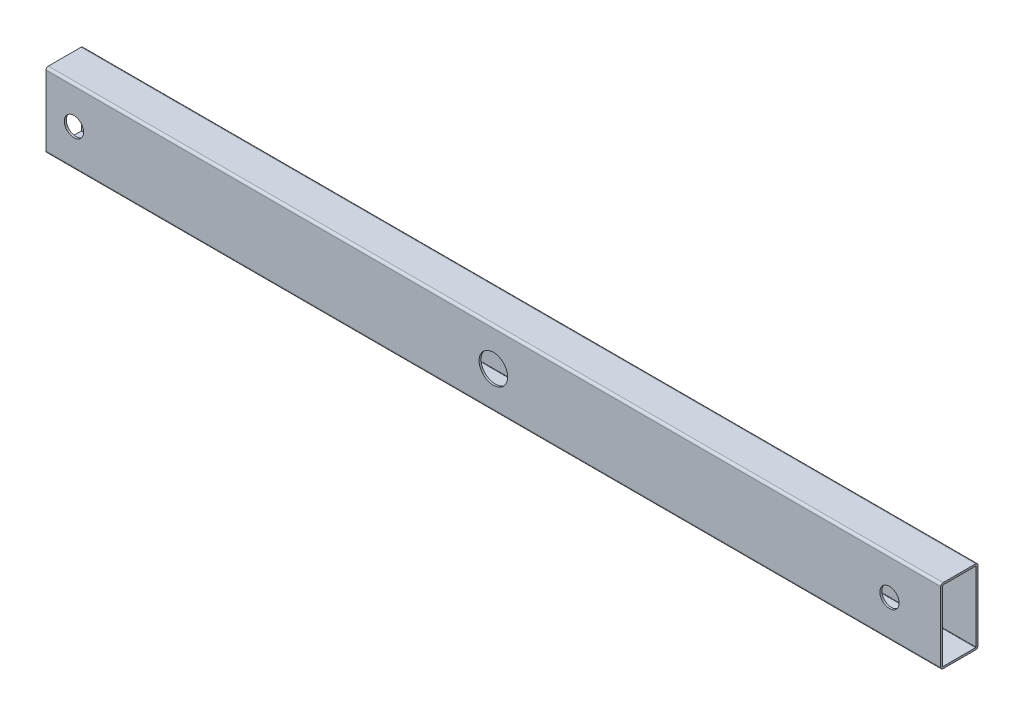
ISO-10303-21;
HEADER;
FILE_DESCRIPTION(('STEP AP214'),'2;1');
FILE_NAME('part.step','',(''),(''),'','','');
FILE_SCHEMA(('AUTOMOTIVE_DESIGN { 1 0 10303 214 1 1 1 1 }'));
ENDSEC;
DATA;
#1=APPLICATION_CONTEXT('core data for automotive mechanical design processes');
#2=APPLICATION_PROTOCOL_DEFINITION('international standard','automotive_design',2000,#1);
#3=PRODUCT_CONTEXT('',#1,'mechanical');
#4=PRODUCT('Part','Part','',(#3));
#5=PRODUCT_RELATED_PRODUCT_CATEGORY('part','',(#4));
#6=PRODUCT_DEFINITION_FORMATION('','',#4);
#7=PRODUCT_DEFINITION_CONTEXT('part definition',#1,'design');
#8=PRODUCT_DEFINITION('design','',#6,#7);
#9=PRODUCT_DEFINITION_SHAPE('','',#8);
#10=(LENGTH_UNIT() NAMED_UNIT(*) SI_UNIT(.MILLI.,.METRE.));
#11=(NAMED_UNIT(*) PLANE_ANGLE_UNIT() SI_UNIT($,.RADIAN.));
#12=(NAMED_UNIT(*) SI_UNIT($,.STERADIAN.) SOLID_ANGLE_UNIT());
#13=UNCERTAINTY_MEASURE_WITH_UNIT(LENGTH_MEASURE(1.E-05),#10,'distance_accuracy_value','');
#14=(GEOMETRIC_REPRESENTATION_CONTEXT(3) GLOBAL_UNCERTAINTY_ASSIGNED_CONTEXT((#13)) GLOBAL_UNIT_ASSIGNED_CONTEXT((#10,
#11,#12)) REPRESENTATION_CONTEXT('',''));
#15=CARTESIAN_POINT('',(0.,0.,0.));
#16=DIRECTION('',(0.,0.,1.));
#17=DIRECTION('',(1.,0.,0.));
#18=AXIS2_PLACEMENT_3D('',#15,#16,#17);
#19=CARTESIAN_POINT('',(609.6,3.65674086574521,-16.8519621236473));
#20=DIRECTION('',(-1.,0.,0.));
#21=DIRECTION('',(0.,0.,1.));
#22=AXIS2_PLACEMENT_3D('',#19,#20,#21);
#23=PLANE('',#22);
#24=CARTESIAN_POINT('',(609.6,3.65674086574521,-16.8519621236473));
#25=DIRECTION('',(1.,0.,0.));
#26=DIRECTION('',(0.,0.,1.));
#27=AXIS2_PLACEMENT_3D('',#24,#25,#26);
#28=CIRCLE('',#27,1.5875);
#29=CARTESIAN_POINT('',(609.6,3.6567408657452,-18.4394621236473));
#30=VERTEX_POINT('',#29);
#31=CARTESIAN_POINT('',(609.6,5.24424086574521,-16.8519621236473));
#32=VERTEX_POINT('',#31);
#33=EDGE_CURVE('E215',#30,#32,#28,.T.);
#34=ORIENTED_EDGE('',*,*,#33,.T.);
#35=DIRECTION('',(0.,0.,1.));
#36=VECTOR('',#35,1.);
#37=CARTESIAN_POINT('',(609.6,5.24424086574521,5.37303787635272));
#38=LINE('',#37,#36);
#39=CARTESIAN_POINT('',(609.6,5.24424086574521,5.37303787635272));
#40=VERTEX_POINT('',#39);
#41=EDGE_CURVE('E218',#32,#40,#38,.T.);
#42=ORIENTED_EDGE('',*,*,#41,.T.);
#43=CARTESIAN_POINT('',(609.6,3.65674086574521,5.37303787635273));
#44=DIRECTION('',(1.,0.,0.));
#45=DIRECTION('',(0.,0.,1.));
#46=AXIS2_PLACEMENT_3D('',#43,#44,#45);
#47=CIRCLE('',#46,1.5875);
#48=CARTESIAN_POINT('',(609.6,3.6567408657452,6.96053787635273));
#49=VERTEX_POINT('',#48);
#50=EDGE_CURVE('E221',#40,#49,#47,.T.);
#51=ORIENTED_EDGE('',*,*,#50,.T.);
#52=DIRECTION('',(0.,-1.,0.));
#53=VECTOR('',#52,1.);
#54=CARTESIAN_POINT('',(609.6,3.6567408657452,6.96053787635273));
#55=LINE('',#54,#53);
#56=CARTESIAN_POINT('',(609.6,-43.9682591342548,6.96053787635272));
#57=VERTEX_POINT('',#56);
#58=EDGE_CURVE('E223',#49,#57,#55,.T.);
#59=ORIENTED_EDGE('',*,*,#58,.T.);
#60=CARTESIAN_POINT('',(609.6,-43.9682591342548,5.37303787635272));
#61=DIRECTION('',(1.,0.,0.));
#62=DIRECTION('',(0.,0.,1.));
#63=AXIS2_PLACEMENT_3D('',#60,#61,#62);
#64=CIRCLE('',#63,1.5875);
#65=CARTESIAN_POINT('',(609.6,-45.5557591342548,5.37303787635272));
#66=VERTEX_POINT('',#65);
#67=EDGE_CURVE('E225',#57,#66,#64,.T.);
#68=ORIENTED_EDGE('',*,*,#67,.T.);
#69=DIRECTION('',(0.,0.,-1.));
#70=VECTOR('',#69,1.);
#71=CARTESIAN_POINT('',(609.6,-45.5557591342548,5.37303787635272));
#72=LINE('',#71,#70);
#73=CARTESIAN_POINT('',(609.6,-45.5557591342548,-16.8519621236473));
#74=VERTEX_POINT('',#73);
#75=EDGE_CURVE('E227',#66,#74,#72,.T.);
#76=ORIENTED_EDGE('',*,*,#75,.T.);
#77=CARTESIAN_POINT('',(609.6,-43.9682591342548,-16.8519621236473));
#78=DIRECTION('',(1.,0.,0.));
#79=DIRECTION('',(0.,0.,1.));
#80=AXIS2_PLACEMENT_3D('',#77,#78,#79);
#81=CIRCLE('',#80,1.5875);
#82=CARTESIAN_POINT('',(609.6,-43.9682591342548,-18.4394621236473));
#83=VERTEX_POINT('',#82);
#84=EDGE_CURVE('E229',#74,#83,#81,.T.);
#85=ORIENTED_EDGE('',*,*,#84,.T.);
#86=DIRECTION('',(0.,1.,0.));
#87=VECTOR('',#86,1.);
#88=CARTESIAN_POINT('',(609.6,3.6567408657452,-18.4394621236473));
#89=LINE('',#88,#87);
#90=EDGE_CURVE('E231',#83,#30,#89,.T.);
#91=ORIENTED_EDGE('',*,*,#90,.T.);
#92=EDGE_LOOP('',(#34,#42,#51,#59,#68,#76,#85,#91));
#93=FACE_BOUND('',#92,.T.);
#94=CARTESIAN_POINT('',(609.6,3.65674086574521,5.37303787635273));
#95=DIRECTION('',(1.,0.,0.));
#96=DIRECTION('',(0.,0.,1.));
#97=AXIS2_PLACEMENT_3D('',#94,#95,#96);
#98=CIRCLE('',#97,0.2413);
#99=CARTESIAN_POINT('',(609.6,3.89804086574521,5.37303787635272));
#100=VERTEX_POINT('',#99);
#101=CARTESIAN_POINT('',(609.6,3.6567408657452,5.61433787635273));
#102=VERTEX_POINT('',#101);
#103=EDGE_CURVE('E148',#100,#102,#98,.T.);
#104=ORIENTED_EDGE('',*,*,#103,.F.);
#105=DIRECTION('',(0.,0.,1.));
#106=VECTOR('',#105,1.);
#107=CARTESIAN_POINT('',(609.6,3.89804086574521,5.37303787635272));
#108=LINE('',#107,#106);
#109=CARTESIAN_POINT('',(609.6,3.89804086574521,-16.8519621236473));
#110=VERTEX_POINT('',#109);
#111=EDGE_CURVE('E182',#110,#100,#108,.T.);
#112=ORIENTED_EDGE('',*,*,#111,.F.);
#113=CARTESIAN_POINT('',(609.6,3.65674086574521,-16.8519621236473));
#114=DIRECTION('',(1.,0.,0.));
#115=DIRECTION('',(0.,0.,1.));
#116=AXIS2_PLACEMENT_3D('',#113,#114,#115);
#117=CIRCLE('',#116,0.2413);
#118=CARTESIAN_POINT('',(609.6,3.65674086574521,-17.0932621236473));
#119=VERTEX_POINT('',#118);
#120=EDGE_CURVE('E180',#119,#110,#117,.T.);
#121=ORIENTED_EDGE('',*,*,#120,.F.);
#122=DIRECTION('',(0.,1.,0.));
#123=VECTOR('',#122,1.);
#124=CARTESIAN_POINT('',(609.6,3.65674086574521,-17.0932621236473));
#125=LINE('',#124,#123);
#126=CARTESIAN_POINT('',(609.6,-43.9682591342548,-17.0932621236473));
#127=VERTEX_POINT('',#126);
#128=EDGE_CURVE('E178',#127,#119,#125,.T.);
#129=ORIENTED_EDGE('',*,*,#128,.F.);
#130=CARTESIAN_POINT('',(609.6,-43.9682591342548,-16.8519621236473));
#131=DIRECTION('',(1.,0.,0.));
#132=DIRECTION('',(0.,0.,1.));
#133=AXIS2_PLACEMENT_3D('',#130,#131,#132);
#134=CIRCLE('',#133,0.2413);
#135=CARTESIAN_POINT('',(609.6,-44.2095591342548,-16.8519621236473));
#136=VERTEX_POINT('',#135);
#137=EDGE_CURVE('E176',#136,#127,#134,.T.);
#138=ORIENTED_EDGE('',*,*,#137,.F.);
#139=DIRECTION('',(0.,0.,-1.));
#140=VECTOR('',#139,1.);
#141=CARTESIAN_POINT('',(609.6,-44.2095591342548,5.37303787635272));
#142=LINE('',#141,#140);
#143=CARTESIAN_POINT('',(609.6,-44.2095591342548,5.37303787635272));
#144=VERTEX_POINT('',#143);
#145=EDGE_CURVE('E171',#144,#136,#142,.T.);
#146=ORIENTED_EDGE('',*,*,#145,.F.);
#147=CARTESIAN_POINT('',(609.6,-43.9682591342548,5.37303787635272));
#148=DIRECTION('',(1.,0.,0.));
#149=DIRECTION('',(0.,0.,1.));
#150=AXIS2_PLACEMENT_3D('',#147,#148,#149);
#151=CIRCLE('',#150,0.2413);
#152=CARTESIAN_POINT('',(609.6,-43.9682591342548,5.61433787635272));
#153=VERTEX_POINT('',#152);
#154=EDGE_CURVE('E169',#153,#144,#151,.T.);
#155=ORIENTED_EDGE('',*,*,#154,.F.);
#156=DIRECTION('',(0.,-1.,0.));
#157=VECTOR('',#156,1.);
#158=CARTESIAN_POINT('',(609.6,3.6567408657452,5.61433787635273));
#159=LINE('',#158,#157);
#160=EDGE_CURVE('E156',#102,#153,#159,.T.);
#161=ORIENTED_EDGE('',*,*,#160,.F.);
#162=EDGE_LOOP('',(#104,#112,#121,#129,#138,#146,#155,#161));
#163=FACE_BOUND('',#162,.T.);
#164=ADVANCED_FACE('F33',(#93,#163),#23,.F.);
#165=CARTESIAN_POINT('',(0.,3.65674086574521,-16.8519621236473));
#166=DIRECTION('',(-1.,0.,0.));
#167=DIRECTION('',(0.,0.,1.));
#168=AXIS2_PLACEMENT_3D('',#165,#166,#167);
#169=PLANE('',#168);
#170=CARTESIAN_POINT('',(0.,3.65674086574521,-16.8519621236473));
#171=DIRECTION('',(1.,0.,0.));
#172=DIRECTION('',(0.,0.,1.));
#173=AXIS2_PLACEMENT_3D('',#170,#171,#172);
#174=CIRCLE('',#173,1.5875);
#175=CARTESIAN_POINT('',(0.,3.6567408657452,-18.4394621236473));
#176=VERTEX_POINT('',#175);
#177=CARTESIAN_POINT('',(0.,5.24424086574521,-16.8519621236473));
#178=VERTEX_POINT('',#177);
#179=EDGE_CURVE('E164',#176,#178,#174,.T.);
#180=ORIENTED_EDGE('',*,*,#179,.F.);
#181=DIRECTION('',(0.,1.,0.));
#182=VECTOR('',#181,1.);
#183=CARTESIAN_POINT('',(0.,3.6567408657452,-18.4394621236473));
#184=LINE('',#183,#182);
#185=CARTESIAN_POINT('',(0.,-43.9682591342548,-18.4394621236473));
#186=VERTEX_POINT('',#185);
#187=EDGE_CURVE('E219',#186,#176,#184,.T.);
#188=ORIENTED_EDGE('',*,*,#187,.F.);
#189=CARTESIAN_POINT('',(0.,-43.9682591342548,-16.8519621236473));
#190=DIRECTION('',(1.,0.,0.));
#191=DIRECTION('',(0.,0.,1.));
#192=AXIS2_PLACEMENT_3D('',#189,#190,#191);
#193=CIRCLE('',#192,1.5875);
#194=CARTESIAN_POINT('',(0.,-45.5557591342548,-16.8519621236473));
#195=VERTEX_POINT('',#194);
#196=EDGE_CURVE('E246',#195,#186,#193,.T.);
#197=ORIENTED_EDGE('',*,*,#196,.F.);
#198=DIRECTION('',(0.,0.,-1.));
#199=VECTOR('',#198,1.);
#200=CARTESIAN_POINT('',(0.,-45.5557591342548,5.37303787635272));
#201=LINE('',#200,#199);
#202=CARTESIAN_POINT('',(0.,-45.5557591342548,5.37303787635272));
#203=VERTEX_POINT('',#202);
#204=EDGE_CURVE('E244',#203,#195,#201,.T.);
#205=ORIENTED_EDGE('',*,*,#204,.F.);
#206=CARTESIAN_POINT('',(0.,-43.9682591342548,5.37303787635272));
#207=DIRECTION('',(1.,0.,0.));
#208=DIRECTION('',(0.,0.,1.));
#209=AXIS2_PLACEMENT_3D('',#206,#207,#208);
#210=CIRCLE('',#209,1.5875);
#211=CARTESIAN_POINT('',(0.,-43.9682591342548,6.96053787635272));
#212=VERTEX_POINT('',#211);
#213=EDGE_CURVE('E242',#212,#203,#210,.T.);
#214=ORIENTED_EDGE('',*,*,#213,.F.);
#215=DIRECTION('',(0.,-1.,0.));
#216=VECTOR('',#215,1.);
#217=CARTESIAN_POINT('',(0.,3.6567408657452,6.96053787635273));
#218=LINE('',#217,#216);
#219=CARTESIAN_POINT('',(0.,3.6567408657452,6.96053787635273));
#220=VERTEX_POINT('',#219);
#221=EDGE_CURVE('E240',#220,#212,#218,.T.);
#222=ORIENTED_EDGE('',*,*,#221,.F.);
#223=CARTESIAN_POINT('',(0.,3.65674086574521,5.37303787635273));
#224=DIRECTION('',(1.,0.,0.));
#225=DIRECTION('',(0.,0.,1.));
#226=AXIS2_PLACEMENT_3D('',#223,#224,#225);
#227=CIRCLE('',#226,1.5875);
#228=CARTESIAN_POINT('',(0.,5.24424086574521,5.37303787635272));
#229=VERTEX_POINT('',#228);
#230=EDGE_CURVE('E238',#229,#220,#227,.T.);
#231=ORIENTED_EDGE('',*,*,#230,.F.);
#232=DIRECTION('',(0.,0.,1.));
#233=VECTOR('',#232,1.);
#234=CARTESIAN_POINT('',(0.,5.24424086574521,5.37303787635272));
#235=LINE('',#234,#233);
#236=EDGE_CURVE('E236',#178,#229,#235,.T.);
#237=ORIENTED_EDGE('',*,*,#236,.F.);
#238=EDGE_LOOP('',(#180,#188,#197,#205,#214,#222,#231,#237));
#239=FACE_BOUND('',#238,.T.);
#240=DIRECTION('',(0.,0.,1.));
#241=VECTOR('',#240,1.);
#242=CARTESIAN_POINT('',(0.,3.89804086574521,5.37303787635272));
#243=LINE('',#242,#241);
#244=CARTESIAN_POINT('',(0.,3.89804086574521,-16.8519621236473));
#245=VERTEX_POINT('',#244);
#246=CARTESIAN_POINT('',(0.,3.89804086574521,5.37303787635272));
#247=VERTEX_POINT('',#246);
#248=EDGE_CURVE('E157',#245,#247,#243,.T.);
#249=ORIENTED_EDGE('',*,*,#248,.T.);
#250=CARTESIAN_POINT('',(0.,3.65674086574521,5.37303787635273));
#251=DIRECTION('',(1.,0.,0.));
#252=DIRECTION('',(0.,0.,1.));
#253=AXIS2_PLACEMENT_3D('',#250,#251,#252);
#254=CIRCLE('',#253,0.2413);
#255=CARTESIAN_POINT('',(0.,3.6567408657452,5.61433787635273));
#256=VERTEX_POINT('',#255);
#257=EDGE_CURVE('E58',#247,#256,#254,.T.);
#258=ORIENTED_EDGE('',*,*,#257,.T.);
#259=DIRECTION('',(0.,-1.,0.));
#260=VECTOR('',#259,1.);
#261=CARTESIAN_POINT('',(0.,3.6567408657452,5.61433787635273));
#262=LINE('',#261,#260);
#263=CARTESIAN_POINT('',(0.,-43.9682591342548,5.61433787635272));
#264=VERTEX_POINT('',#263);
#265=EDGE_CURVE('E163',#256,#264,#262,.T.);
#266=ORIENTED_EDGE('',*,*,#265,.T.);
#267=CARTESIAN_POINT('',(0.,-43.9682591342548,5.37303787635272));
#268=DIRECTION('',(1.,0.,0.));
#269=DIRECTION('',(0.,0.,1.));
#270=AXIS2_PLACEMENT_3D('',#267,#268,#269);
#271=CIRCLE('',#270,0.2413);
#272=CARTESIAN_POINT('',(0.,-44.2095591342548,5.37303787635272));
#273=VERTEX_POINT('',#272);
#274=EDGE_CURVE('E187',#264,#273,#271,.T.);
#275=ORIENTED_EDGE('',*,*,#274,.T.);
#276=DIRECTION('',(0.,0.,-1.));
#277=VECTOR('',#276,1.);
#278=CARTESIAN_POINT('',(0.,-44.2095591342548,5.37303787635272));
#279=LINE('',#278,#277);
#280=CARTESIAN_POINT('',(0.,-44.2095591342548,-16.8519621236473));
#281=VERTEX_POINT('',#280);
#282=EDGE_CURVE('E190',#273,#281,#279,.T.);
#283=ORIENTED_EDGE('',*,*,#282,.T.);
#284=CARTESIAN_POINT('',(0.,-43.9682591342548,-16.8519621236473));
#285=DIRECTION('',(1.,0.,0.));
#286=DIRECTION('',(0.,0.,1.));
#287=AXIS2_PLACEMENT_3D('',#284,#285,#286);
#288=CIRCLE('',#287,0.2413);
#289=CARTESIAN_POINT('',(0.,-43.9682591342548,-17.0932621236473));
#290=VERTEX_POINT('',#289);
#291=EDGE_CURVE('E193',#281,#290,#288,.T.);
#292=ORIENTED_EDGE('',*,*,#291,.T.);
#293=DIRECTION('',(0.,1.,0.));
#294=VECTOR('',#293,1.);
#295=CARTESIAN_POINT('',(0.,3.65674086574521,-17.0932621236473));
#296=LINE('',#295,#294);
#297=CARTESIAN_POINT('',(0.,3.65674086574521,-17.0932621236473));
#298=VERTEX_POINT('',#297);
#299=EDGE_CURVE('E196',#290,#298,#296,.T.);
#300=ORIENTED_EDGE('',*,*,#299,.T.);
#301=CARTESIAN_POINT('',(0.,3.65674086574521,-16.8519621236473));
#302=DIRECTION('',(1.,0.,0.));
#303=DIRECTION('',(0.,0.,1.));
#304=AXIS2_PLACEMENT_3D('',#301,#302,#303);
#305=CIRCLE('',#304,0.2413);
#306=EDGE_CURVE('E199',#298,#245,#305,.T.);
#307=ORIENTED_EDGE('',*,*,#306,.T.);
#308=EDGE_LOOP('',(#249,#258,#266,#275,#283,#292,#300,#307));
#309=FACE_BOUND('',#308,.T.);
#310=ADVANCED_FACE('F315',(#239,#309),#169,.T.);
#311=CARTESIAN_POINT('',(609.6,3.65674086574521,-16.8519621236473));
#312=DIRECTION('',(-1.,0.,0.));
#313=DIRECTION('',(0.,0.,1.));
#314=AXIS2_PLACEMENT_3D('',#311,#312,#313);
#315=CYLINDRICAL_SURFACE('',#314,1.5875);
#316=ORIENTED_EDGE('',*,*,#179,.T.);
#317=DIRECTION('',(-1.,0.,0.));
#318=VECTOR('',#317,1.);
#319=CARTESIAN_POINT('',(609.6,5.24424086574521,-16.8519621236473));
#320=LINE('',#319,#318);
#321=EDGE_CURVE('E11',#32,#178,#320,.T.);
#322=ORIENTED_EDGE('',*,*,#321,.F.);
#323=ORIENTED_EDGE('',*,*,#33,.F.);
#324=DIRECTION('',(-1.,0.,0.));
#325=VECTOR('',#324,1.);
#326=CARTESIAN_POINT('',(609.6,3.6567408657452,-18.4394621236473));
#327=LINE('',#326,#325);
#328=EDGE_CURVE('E233',#30,#176,#327,.T.);
#329=ORIENTED_EDGE('',*,*,#328,.T.);
#330=EDGE_LOOP('',(#316,#322,#323,#329));
#331=FACE_BOUND('',#330,.T.);
#332=ADVANCED_FACE('F35',(#331),#315,.T.);
#333=CARTESIAN_POINT('',(609.6,5.24424086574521,5.37303787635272));
#334=DIRECTION('',(0.,-1.,0.));
#335=DIRECTION('',(0.,0.,-1.));
#336=AXIS2_PLACEMENT_3D('',#333,#334,#335);
#337=PLANE('',#336);
#338=ORIENTED_EDGE('',*,*,#236,.T.);
#339=DIRECTION('',(-1.,0.,0.));
#340=VECTOR('',#339,1.);
#341=CARTESIAN_POINT('',(609.6,5.24424086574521,5.37303787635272));
#342=LINE('',#341,#340);
#343=EDGE_CURVE('E42',#40,#229,#342,.T.);
#344=ORIENTED_EDGE('',*,*,#343,.F.);
#345=ORIENTED_EDGE('',*,*,#41,.F.);
#346=ORIENTED_EDGE('',*,*,#321,.T.);
#347=EDGE_LOOP('',(#338,#344,#345,#346));
#348=FACE_BOUND('',#347,.T.);
#349=ADVANCED_FACE('F345',(#348),#337,.F.);
#350=CARTESIAN_POINT('',(609.6,3.65674086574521,5.37303787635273));
#351=DIRECTION('',(-1.,0.,0.));
#352=DIRECTION('',(0.,0.,1.));
#353=AXIS2_PLACEMENT_3D('',#350,#351,#352);
#354=CYLINDRICAL_SURFACE('',#353,1.5875);
#355=ORIENTED_EDGE('',*,*,#230,.T.);
#356=DIRECTION('',(-1.,0.,0.));
#357=VECTOR('',#356,1.);
#358=CARTESIAN_POINT('',(609.6,3.6567408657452,6.96053787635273));
#359=LINE('',#358,#357);
#360=EDGE_CURVE('E263',#49,#220,#359,.T.);
#361=ORIENTED_EDGE('',*,*,#360,.F.);
#362=ORIENTED_EDGE('',*,*,#50,.F.);
#363=ORIENTED_EDGE('',*,*,#343,.T.);
#364=EDGE_LOOP('',(#355,#361,#362,#363));
#365=FACE_BOUND('',#364,.T.);
#366=ADVANCED_FACE('F342',(#365),#354,.T.);
#367=CARTESIAN_POINT('',(609.6,3.6567408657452,6.96053787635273));
#368=DIRECTION('',(0.,0.,-1.));
#369=DIRECTION('',(0.,1.,0.));
#370=AXIS2_PLACEMENT_3D('',#367,#368,#369);
#371=PLANE('',#370);
#372=CARTESIAN_POINT('',(574.675,-20.1557591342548,6.96053787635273));
#373=DIRECTION('',(0.,0.,-1.));
#374=DIRECTION('',(0.,1.,0.));
#375=AXIS2_PLACEMENT_3D('',#372,#373,#374);
#376=CIRCLE('',#375,6.5484375);
#377=CARTESIAN_POINT('',(574.675,-13.6073216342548,6.96053787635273));
#378=VERTEX_POINT('',#377);
#379=EDGE_CURVE('E436',#378,#378,#376,.T.);
#380=ORIENTED_EDGE('',*,*,#379,.T.);
#381=EDGE_LOOP('',(#380));
#382=FACE_BOUND('',#381,.T.);
#383=CARTESIAN_POINT('',(19.05,-20.1557591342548,6.96053787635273));
#384=DIRECTION('',(0.,0.,1.));
#385=DIRECTION('',(1.,0.,0.));
#386=AXIS2_PLACEMENT_3D('',#383,#384,#385);
#387=CIRCLE('',#386,6.5484375);
#388=CARTESIAN_POINT('',(25.5984375,-20.1557591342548,6.96053787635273));
#389=VERTEX_POINT('',#388);
#390=EDGE_CURVE('E281',#389,#389,#387,.T.);
#391=ORIENTED_EDGE('',*,*,#390,.F.);
#392=EDGE_LOOP('',(#391));
#393=FACE_BOUND('',#392,.T.);
#394=CARTESIAN_POINT('',(304.8,-20.1557591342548,6.96053787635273));
#395=DIRECTION('',(0.,0.,1.));
#396=DIRECTION('',(1.,0.,0.));
#397=AXIS2_PLACEMENT_3D('',#394,#395,#396);
#398=CIRCLE('',#397,9.72343749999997);
#399=CARTESIAN_POINT('',(314.5234375,-20.1557591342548,6.96053787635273));
#400=VERTEX_POINT('',#399);
#401=EDGE_CURVE('E278',#400,#400,#398,.T.);
#402=ORIENTED_EDGE('',*,*,#401,.F.);
#403=EDGE_LOOP('',(#402));
#404=FACE_BOUND('',#403,.T.);
#405=ORIENTED_EDGE('',*,*,#221,.T.);
#406=DIRECTION('',(-1.,0.,0.));
#407=VECTOR('',#406,1.);
#408=CARTESIAN_POINT('',(609.6,-43.9682591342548,6.96053787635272));
#409=LINE('',#408,#407);
#410=EDGE_CURVE('E260',#57,#212,#409,.T.);
#411=ORIENTED_EDGE('',*,*,#410,.F.);
#412=ORIENTED_EDGE('',*,*,#58,.F.);
#413=ORIENTED_EDGE('',*,*,#360,.T.);
#414=EDGE_LOOP('',(#405,#411,#412,#413));
#415=FACE_BOUND('',#414,.T.);
#416=ADVANCED_FACE('F338',(#382,#393,#404,#415),#371,.F.);
#417=CARTESIAN_POINT('',(609.6,-43.9682591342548,5.37303787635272));
#418=DIRECTION('',(-1.,0.,0.));
#419=DIRECTION('',(0.,0.,1.));
#420=AXIS2_PLACEMENT_3D('',#417,#418,#419);
#421=CYLINDRICAL_SURFACE('',#420,1.5875);
#422=ORIENTED_EDGE('',*,*,#213,.T.);
#423=DIRECTION('',(-1.,0.,0.));
#424=VECTOR('',#423,1.);
#425=CARTESIAN_POINT('',(609.6,-45.5557591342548,5.37303787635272));
#426=LINE('',#425,#424);
#427=EDGE_CURVE('E257',#66,#203,#426,.T.);
#428=ORIENTED_EDGE('',*,*,#427,.F.);
#429=ORIENTED_EDGE('',*,*,#67,.F.);
#430=ORIENTED_EDGE('',*,*,#410,.T.);
#431=EDGE_LOOP('',(#422,#428,#429,#430));
#432=FACE_BOUND('',#431,.T.);
#433=ADVANCED_FACE('F334',(#432),#421,.T.);
#434=CARTESIAN_POINT('',(609.6,-45.5557591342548,5.37303787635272));
#435=DIRECTION('',(0.,1.,0.));
#436=DIRECTION('',(0.,0.,1.));
#437=AXIS2_PLACEMENT_3D('',#434,#435,#436);
#438=PLANE('',#437);
#439=ORIENTED_EDGE('',*,*,#204,.T.);
#440=DIRECTION('',(-1.,0.,0.));
#441=VECTOR('',#440,1.);
#442=CARTESIAN_POINT('',(609.6,-45.5557591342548,-16.8519621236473));
#443=LINE('',#442,#441);
#444=EDGE_CURVE('E254',#74,#195,#443,.T.);
#445=ORIENTED_EDGE('',*,*,#444,.F.);
#446=ORIENTED_EDGE('',*,*,#75,.F.);
#447=ORIENTED_EDGE('',*,*,#427,.T.);
#448=EDGE_LOOP('',(#439,#445,#446,#447));
#449=FACE_BOUND('',#448,.T.);
#450=ADVANCED_FACE('F330',(#449),#438,.F.);
#451=CARTESIAN_POINT('',(609.6,-43.9682591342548,-16.8519621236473));
#452=DIRECTION('',(-1.,0.,0.));
#453=DIRECTION('',(0.,0.,1.));
#454=AXIS2_PLACEMENT_3D('',#451,#452,#453);
#455=CYLINDRICAL_SURFACE('',#454,1.5875);
#456=ORIENTED_EDGE('',*,*,#196,.T.);
#457=DIRECTION('',(-1.,0.,0.));
#458=VECTOR('',#457,1.);
#459=CARTESIAN_POINT('',(609.6,-43.9682591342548,-18.4394621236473));
#460=LINE('',#459,#458);
#461=EDGE_CURVE('E251',#83,#186,#460,.T.);
#462=ORIENTED_EDGE('',*,*,#461,.F.);
#463=ORIENTED_EDGE('',*,*,#84,.F.);
#464=ORIENTED_EDGE('',*,*,#444,.T.);
#465=EDGE_LOOP('',(#456,#462,#463,#464));
#466=FACE_BOUND('',#465,.T.);
#467=ADVANCED_FACE('F326',(#466),#455,.T.);
#468=CARTESIAN_POINT('',(609.6,3.6567408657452,-18.4394621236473));
#469=DIRECTION('',(0.,0.,1.));
#470=DIRECTION('',(0.,-1.,0.));
#471=AXIS2_PLACEMENT_3D('',#468,#469,#470);
#472=PLANE('',#471);
#473=CARTESIAN_POINT('',(574.675,-20.1557591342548,-18.4394621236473));
#474=DIRECTION('',(0.,0.,-1.));
#475=DIRECTION('',(0.,1.,0.));
#476=AXIS2_PLACEMENT_3D('',#473,#474,#475);
#477=CIRCLE('',#476,6.5484375);
#478=CARTESIAN_POINT('',(574.675,-13.6073216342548,-18.4394621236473));
#479=VERTEX_POINT('',#478);
#480=EDGE_CURVE('E435',#479,#479,#477,.T.);
#481=ORIENTED_EDGE('',*,*,#480,.F.);
#482=EDGE_LOOP('',(#481));
#483=FACE_BOUND('',#482,.T.);
#484=CARTESIAN_POINT('',(19.05,-20.1557591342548,-18.4394621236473));
#485=DIRECTION('',(0.,0.,1.));
#486=DIRECTION('',(1.,0.,0.));
#487=AXIS2_PLACEMENT_3D('',#484,#485,#486);
#488=CIRCLE('',#487,6.5484375);
#489=CARTESIAN_POINT('',(25.5984375,-20.1557591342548,-18.4394621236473));
#490=VERTEX_POINT('',#489);
#491=EDGE_CURVE('E274',#490,#490,#488,.T.);
#492=ORIENTED_EDGE('',*,*,#491,.T.);
#493=EDGE_LOOP('',(#492));
#494=FACE_BOUND('',#493,.T.);
#495=CARTESIAN_POINT('',(304.8,-20.1557591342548,-18.4394621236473));
#496=DIRECTION('',(0.,0.,1.));
#497=DIRECTION('',(1.,0.,0.));
#498=AXIS2_PLACEMENT_3D('',#495,#496,#497);
#499=CIRCLE('',#498,9.72343749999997);
#500=CARTESIAN_POINT('',(314.5234375,-20.1557591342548,-18.4394621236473));
#501=VERTEX_POINT('',#500);
#502=EDGE_CURVE('E270',#501,#501,#499,.T.);
#503=ORIENTED_EDGE('',*,*,#502,.T.);
#504=EDGE_LOOP('',(#503));
#505=FACE_BOUND('',#504,.T.);
#506=ORIENTED_EDGE('',*,*,#187,.T.);
#507=ORIENTED_EDGE('',*,*,#328,.F.);
#508=ORIENTED_EDGE('',*,*,#90,.F.);
#509=ORIENTED_EDGE('',*,*,#461,.T.);
#510=EDGE_LOOP('',(#506,#507,#508,#509));
#511=FACE_BOUND('',#510,.T.);
#512=ADVANCED_FACE('F310',(#483,#494,#505,#511),#472,.F.);
#513=CARTESIAN_POINT('',(609.6,3.65674086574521,5.37303787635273));
#514=DIRECTION('',(-1.,0.,0.));
#515=DIRECTION('',(0.,0.,1.));
#516=AXIS2_PLACEMENT_3D('',#513,#514,#515);
#517=CYLINDRICAL_SURFACE('',#516,0.2413);
#518=ORIENTED_EDGE('',*,*,#257,.F.);
#519=DIRECTION('',(-1.,0.,0.));
#520=VECTOR('',#519,1.);
#521=CARTESIAN_POINT('',(609.6,3.89804086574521,5.37303787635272));
#522=LINE('',#521,#520);
#523=EDGE_CURVE('E152',#100,#247,#522,.T.);
#524=ORIENTED_EDGE('',*,*,#523,.F.);
#525=ORIENTED_EDGE('',*,*,#103,.T.);
#526=DIRECTION('',(-1.,0.,0.));
#527=VECTOR('',#526,1.);
#528=CARTESIAN_POINT('',(609.6,3.6567408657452,5.61433787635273));
#529=LINE('',#528,#527);
#530=EDGE_CURVE('E151',#102,#256,#529,.T.);
#531=ORIENTED_EDGE('',*,*,#530,.T.);
#532=EDGE_LOOP('',(#518,#524,#525,#531));
#533=FACE_BOUND('',#532,.T.);
#534=ADVANCED_FACE('F150',(#533),#517,.F.);
#535=CARTESIAN_POINT('',(609.6,3.6567408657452,5.61433787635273));
#536=DIRECTION('',(0.,0.,-1.));
#537=DIRECTION('',(0.,1.,0.));
#538=AXIS2_PLACEMENT_3D('',#535,#536,#537);
#539=PLANE('',#538);
#540=CARTESIAN_POINT('',(574.675,-20.1557591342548,5.61433787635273));
#541=DIRECTION('',(0.,0.,-1.));
#542=DIRECTION('',(0.,1.,0.));
#543=AXIS2_PLACEMENT_3D('',#540,#541,#542);
#544=CIRCLE('',#543,6.5484375);
#545=CARTESIAN_POINT('',(574.675,-13.6073216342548,5.61433787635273));
#546=VERTEX_POINT('',#545);
#547=EDGE_CURVE('E286',#546,#546,#544,.T.);
#548=ORIENTED_EDGE('',*,*,#547,.F.);
#549=EDGE_LOOP('',(#548));
#550=FACE_BOUND('',#549,.T.);
#551=CARTESIAN_POINT('',(19.05,-20.1557591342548,5.61433787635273));
#552=DIRECTION('',(0.,0.,-1.));
#553=DIRECTION('',(0.,1.,0.));
#554=AXIS2_PLACEMENT_3D('',#551,#552,#553);
#555=CIRCLE('',#554,6.5484375);
#556=CARTESIAN_POINT('',(25.5984375,-20.1557591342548,5.61433787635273));
#557=VERTEX_POINT('',#556);
#558=EDGE_CURVE('E273',#557,#557,#555,.T.);
#559=ORIENTED_EDGE('',*,*,#558,.F.);
#560=EDGE_LOOP('',(#559));
#561=FACE_BOUND('',#560,.T.);
#562=CARTESIAN_POINT('',(304.8,-20.1557591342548,5.61433787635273));
#563=DIRECTION('',(0.,0.,-1.));
#564=DIRECTION('',(0.,1.,0.));
#565=AXIS2_PLACEMENT_3D('',#562,#563,#564);
#566=CIRCLE('',#565,9.72343749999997);
#567=CARTESIAN_POINT('',(314.5234375,-20.1557591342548,5.61433787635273));
#568=VERTEX_POINT('',#567);
#569=EDGE_CURVE('E185',#568,#568,#566,.T.);
#570=ORIENTED_EDGE('',*,*,#569,.F.);
#571=EDGE_LOOP('',(#570));
#572=FACE_BOUND('',#571,.T.);
#573=ORIENTED_EDGE('',*,*,#265,.F.);
#574=ORIENTED_EDGE('',*,*,#530,.F.);
#575=ORIENTED_EDGE('',*,*,#160,.T.);
#576=DIRECTION('',(-1.,0.,0.));
#577=VECTOR('',#576,1.);
#578=CARTESIAN_POINT('',(609.6,-43.9682591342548,5.61433787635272));
#579=LINE('',#578,#577);
#580=EDGE_CURVE('E165',#153,#264,#579,.T.);
#581=ORIENTED_EDGE('',*,*,#580,.T.);
#582=EDGE_LOOP('',(#573,#574,#575,#581));
#583=FACE_BOUND('',#582,.T.);
#584=ADVANCED_FACE('F160',(#550,#561,#572,#583),#539,.T.);
#585=CARTESIAN_POINT('',(609.6,-43.9682591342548,5.37303787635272));
#586=DIRECTION('',(-1.,0.,0.));
#587=DIRECTION('',(0.,0.,1.));
#588=AXIS2_PLACEMENT_3D('',#585,#586,#587);
#589=CYLINDRICAL_SURFACE('',#588,0.2413);
#590=ORIENTED_EDGE('',*,*,#274,.F.);
#591=ORIENTED_EDGE('',*,*,#580,.F.);
#592=ORIENTED_EDGE('',*,*,#154,.T.);
#593=DIRECTION('',(-1.,0.,0.));
#594=VECTOR('',#593,1.);
#595=CARTESIAN_POINT('',(609.6,-44.2095591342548,5.37303787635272));
#596=LINE('',#595,#594);
#597=EDGE_CURVE('E212',#144,#273,#596,.T.);
#598=ORIENTED_EDGE('',*,*,#597,.T.);
#599=EDGE_LOOP('',(#590,#591,#592,#598));
#600=FACE_BOUND('',#599,.T.);
#601=ADVANCED_FACE('F300',(#600),#589,.F.);
#602=CARTESIAN_POINT('',(609.6,-44.2095591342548,5.37303787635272));
#603=DIRECTION('',(0.,1.,0.));
#604=DIRECTION('',(0.,0.,1.));
#605=AXIS2_PLACEMENT_3D('',#602,#603,#604);
#606=PLANE('',#605);
#607=ORIENTED_EDGE('',*,*,#282,.F.);
#608=ORIENTED_EDGE('',*,*,#597,.F.);
#609=ORIENTED_EDGE('',*,*,#145,.T.);
#610=DIRECTION('',(-1.,0.,0.));
#611=VECTOR('',#610,1.);
#612=CARTESIAN_POINT('',(609.6,-44.2095591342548,-16.8519621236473));
#613=LINE('',#612,#611);
#614=EDGE_CURVE('E210',#136,#281,#613,.T.);
#615=ORIENTED_EDGE('',*,*,#614,.T.);
#616=EDGE_LOOP('',(#607,#608,#609,#615));
#617=FACE_BOUND('',#616,.T.);
#618=ADVANCED_FACE('F307',(#617),#606,.T.);
#619=CARTESIAN_POINT('',(609.6,-43.9682591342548,-16.8519621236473));
#620=DIRECTION('',(-1.,0.,0.));
#621=DIRECTION('',(0.,0.,1.));
#622=AXIS2_PLACEMENT_3D('',#619,#620,#621);
#623=CYLINDRICAL_SURFACE('',#622,0.2413);
#624=ORIENTED_EDGE('',*,*,#291,.F.);
#625=ORIENTED_EDGE('',*,*,#614,.F.);
#626=ORIENTED_EDGE('',*,*,#137,.T.);
#627=DIRECTION('',(-1.,0.,0.));
#628=VECTOR('',#627,1.);
#629=CARTESIAN_POINT('',(609.6,-43.9682591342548,-17.0932621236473));
#630=LINE('',#629,#628);
#631=EDGE_CURVE('E208',#127,#290,#630,.T.);
#632=ORIENTED_EDGE('',*,*,#631,.T.);
#633=EDGE_LOOP('',(#624,#625,#626,#632));
#634=FACE_BOUND('',#633,.T.);
#635=ADVANCED_FACE('F392',(#634),#623,.F.);
#636=CARTESIAN_POINT('',(609.6,3.65674086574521,-17.0932621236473));
#637=DIRECTION('',(0.,0.,1.));
#638=DIRECTION('',(0.,-1.,0.));
#639=AXIS2_PLACEMENT_3D('',#636,#637,#638);
#640=PLANE('',#639);
#641=CARTESIAN_POINT('',(574.675,-20.1557591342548,-17.0932621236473));
#642=DIRECTION('',(0.,0.,1.));
#643=DIRECTION('',(0.,-1.,0.));
#644=AXIS2_PLACEMENT_3D('',#641,#642,#643);
#645=CIRCLE('',#644,6.5484375);
#646=CARTESIAN_POINT('',(574.675,-26.7041966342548,-17.0932621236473));
#647=VERTEX_POINT('',#646);
#648=EDGE_CURVE('E37',#647,#647,#645,.T.);
#649=ORIENTED_EDGE('',*,*,#648,.F.);
#650=EDGE_LOOP('',(#649));
#651=FACE_BOUND('',#650,.T.);
#652=CARTESIAN_POINT('',(19.05,-20.1557591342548,-17.0932621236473));
#653=DIRECTION('',(0.,0.,1.));
#654=DIRECTION('',(0.,-1.,0.));
#655=AXIS2_PLACEMENT_3D('',#652,#653,#654);
#656=CIRCLE('',#655,6.5484375);
#657=CARTESIAN_POINT('',(25.5984375,-20.1557591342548,-17.0932621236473));
#658=VERTEX_POINT('',#657);
#659=EDGE_CURVE('E271',#658,#658,#656,.T.);
#660=ORIENTED_EDGE('',*,*,#659,.F.);
#661=EDGE_LOOP('',(#660));
#662=FACE_BOUND('',#661,.T.);
#663=CARTESIAN_POINT('',(304.8,-20.1557591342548,-17.0932621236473));
#664=DIRECTION('',(0.,0.,1.));
#665=DIRECTION('',(0.,-1.,0.));
#666=AXIS2_PLACEMENT_3D('',#663,#664,#665);
#667=CIRCLE('',#666,9.72343749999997);
#668=CARTESIAN_POINT('',(314.5234375,-20.1557591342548,-17.0932621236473));
#669=VERTEX_POINT('',#668);
#670=EDGE_CURVE('E268',#669,#669,#667,.T.);
#671=ORIENTED_EDGE('',*,*,#670,.F.);
#672=EDGE_LOOP('',(#671));
#673=FACE_BOUND('',#672,.T.);
#674=ORIENTED_EDGE('',*,*,#299,.F.);
#675=ORIENTED_EDGE('',*,*,#631,.F.);
#676=ORIENTED_EDGE('',*,*,#128,.T.);
#677=DIRECTION('',(-1.,0.,0.));
#678=VECTOR('',#677,1.);
#679=CARTESIAN_POINT('',(609.6,3.65674086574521,-17.0932621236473));
#680=LINE('',#679,#678);
#681=EDGE_CURVE('E206',#119,#298,#680,.T.);
#682=ORIENTED_EDGE('',*,*,#681,.T.);
#683=EDGE_LOOP('',(#674,#675,#676,#682));
#684=FACE_BOUND('',#683,.T.);
#685=ADVANCED_FACE('F388',(#651,#662,#673,#684),#640,.T.);
#686=CARTESIAN_POINT('',(609.6,3.65674086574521,-16.8519621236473));
#687=DIRECTION('',(-1.,0.,0.));
#688=DIRECTION('',(0.,0.,1.));
#689=AXIS2_PLACEMENT_3D('',#686,#687,#688);
#690=CYLINDRICAL_SURFACE('',#689,0.2413);
#691=ORIENTED_EDGE('',*,*,#306,.F.);
#692=ORIENTED_EDGE('',*,*,#681,.F.);
#693=ORIENTED_EDGE('',*,*,#120,.T.);
#694=DIRECTION('',(-1.,0.,0.));
#695=VECTOR('',#694,1.);
#696=CARTESIAN_POINT('',(609.6,3.89804086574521,-16.8519621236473));
#697=LINE('',#696,#695);
#698=EDGE_CURVE('E50',#110,#245,#697,.T.);
#699=ORIENTED_EDGE('',*,*,#698,.T.);
#700=EDGE_LOOP('',(#691,#692,#693,#699));
#701=FACE_BOUND('',#700,.T.);
#702=ADVANCED_FACE('F385',(#701),#690,.F.);
#703=CARTESIAN_POINT('',(609.6,3.89804086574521,5.37303787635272));
#704=DIRECTION('',(0.,-1.,0.));
#705=DIRECTION('',(0.,0.,-1.));
#706=AXIS2_PLACEMENT_3D('',#703,#704,#705);
#707=PLANE('',#706);
#708=ORIENTED_EDGE('',*,*,#248,.F.);
#709=ORIENTED_EDGE('',*,*,#698,.F.);
#710=ORIENTED_EDGE('',*,*,#111,.T.);
#711=ORIENTED_EDGE('',*,*,#523,.T.);
#712=EDGE_LOOP('',(#708,#709,#710,#711));
#713=FACE_BOUND('',#712,.T.);
#714=ADVANCED_FACE('F379',(#713),#707,.T.);
#715=CARTESIAN_POINT('',(304.8,-20.1557591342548,-18.4394621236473));
#716=DIRECTION('',(0.,0.,1.));
#717=DIRECTION('',(1.,0.,0.));
#718=AXIS2_PLACEMENT_3D('',#715,#716,#717);
#719=CYLINDRICAL_SURFACE('',#718,9.72343749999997);
#720=CARTESIAN_POINT('',(314.5234375,-20.1557591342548,-17.0932621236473));
#721=CARTESIAN_POINT('',(314.5234375,-20.1557591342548,-17.1072850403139));
#722=CARTESIAN_POINT('',(314.5234375,-20.1557591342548,-17.1213079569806));
#723=CARTESIAN_POINT('',(314.5234375,-20.1557591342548,-17.1493537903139));
#724=CARTESIAN_POINT('',(314.5234375,-20.1557591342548,-17.1633767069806));
#725=CARTESIAN_POINT('',(314.5234375,-20.1557591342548,-17.1914225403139));
#726=CARTESIAN_POINT('',(314.5234375,-20.1557591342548,-17.2054454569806));
#727=CARTESIAN_POINT('',(314.5234375,-20.1557591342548,-17.2334912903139));
#728=CARTESIAN_POINT('',(314.5234375,-20.1557591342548,-17.2475142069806));
#729=CARTESIAN_POINT('',(314.5234375,-20.1557591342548,-17.2755600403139));
#730=CARTESIAN_POINT('',(314.5234375,-20.1557591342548,-17.2895829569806));
#731=CARTESIAN_POINT('',(314.5234375,-20.1557591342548,-17.3176287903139));
#732=CARTESIAN_POINT('',(314.5234375,-20.1557591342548,-17.3316517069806));
#733=CARTESIAN_POINT('',(314.5234375,-20.1557591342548,-17.3596975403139));
#734=CARTESIAN_POINT('',(314.5234375,-20.1557591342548,-17.3737204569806));
#735=CARTESIAN_POINT('',(314.5234375,-20.1557591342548,-17.4017662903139));
#736=CARTESIAN_POINT('',(314.5234375,-20.1557591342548,-17.4157892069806));
#737=CARTESIAN_POINT('',(314.5234375,-20.1557591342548,-17.4438350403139));
#738=CARTESIAN_POINT('',(314.5234375,-20.1557591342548,-17.4578579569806));
#739=CARTESIAN_POINT('',(314.5234375,-20.1557591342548,-17.4859037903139));
#740=CARTESIAN_POINT('',(314.5234375,-20.1557591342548,-17.4999267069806));
#741=CARTESIAN_POINT('',(314.5234375,-20.1557591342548,-17.5279725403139));
#742=CARTESIAN_POINT('',(314.5234375,-20.1557591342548,-17.5419954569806));
#743=CARTESIAN_POINT('',(314.5234375,-20.1557591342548,-17.5700412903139));
#744=CARTESIAN_POINT('',(314.5234375,-20.1557591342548,-17.5840642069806));
#745=CARTESIAN_POINT('',(314.5234375,-20.1557591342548,-17.6121100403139));
#746=CARTESIAN_POINT('',(314.5234375,-20.1557591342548,-17.6261329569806));
#747=CARTESIAN_POINT('',(314.5234375,-20.1557591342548,-17.6541787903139));
#748=CARTESIAN_POINT('',(314.5234375,-20.1557591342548,-17.6682017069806));
#749=CARTESIAN_POINT('',(314.5234375,-20.1557591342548,-17.6962475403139));
#750=CARTESIAN_POINT('',(314.5234375,-20.1557591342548,-17.7102704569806));
#751=CARTESIAN_POINT('',(314.5234375,-20.1557591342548,-17.7383162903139));
#752=CARTESIAN_POINT('',(314.5234375,-20.1557591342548,-17.7523392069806));
#753=CARTESIAN_POINT('',(314.5234375,-20.1557591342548,-17.7803850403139));
#754=CARTESIAN_POINT('',(314.5234375,-20.1557591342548,-17.7944079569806));
#755=CARTESIAN_POINT('',(314.5234375,-20.1557591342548,-17.8224537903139));
#756=CARTESIAN_POINT('',(314.5234375,-20.1557591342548,-17.8364767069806));
#757=CARTESIAN_POINT('',(314.5234375,-20.1557591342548,-17.8645225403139));
#758=CARTESIAN_POINT('',(314.5234375,-20.1557591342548,-17.8785454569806));
#759=CARTESIAN_POINT('',(314.5234375,-20.1557591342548,-17.9065912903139));
#760=CARTESIAN_POINT('',(314.5234375,-20.1557591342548,-17.9206142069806));
#761=CARTESIAN_POINT('',(314.5234375,-20.1557591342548,-17.9486600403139));
#762=CARTESIAN_POINT('',(314.5234375,-20.1557591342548,-17.9626829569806));
#763=CARTESIAN_POINT('',(314.5234375,-20.1557591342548,-17.9907287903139));
#764=CARTESIAN_POINT('',(314.5234375,-20.1557591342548,-18.0047517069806));
#765=CARTESIAN_POINT('',(314.5234375,-20.1557591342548,-18.0327975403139));
#766=CARTESIAN_POINT('',(314.5234375,-20.1557591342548,-18.0468204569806));
#767=CARTESIAN_POINT('',(314.5234375,-20.1557591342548,-18.0748662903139));
#768=CARTESIAN_POINT('',(314.5234375,-20.1557591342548,-18.0888892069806));
#769=CARTESIAN_POINT('',(314.5234375,-20.1557591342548,-18.1169350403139));
#770=CARTESIAN_POINT('',(314.5234375,-20.1557591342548,-18.1309579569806));
#771=CARTESIAN_POINT('',(314.5234375,-20.1557591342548,-18.1590037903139));
#772=CARTESIAN_POINT('',(314.5234375,-20.1557591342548,-18.1730267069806));
#773=CARTESIAN_POINT('',(314.5234375,-20.1557591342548,-18.2010725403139));
#774=CARTESIAN_POINT('',(314.5234375,-20.1557591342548,-18.2150954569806));
#775=CARTESIAN_POINT('',(314.5234375,-20.1557591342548,-18.2431412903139));
#776=CARTESIAN_POINT('',(314.5234375,-20.1557591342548,-18.2571642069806));
#777=CARTESIAN_POINT('',(314.5234375,-20.1557591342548,-18.2852100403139));
#778=CARTESIAN_POINT('',(314.5234375,-20.1557591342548,-18.2992329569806));
#779=CARTESIAN_POINT('',(314.5234375,-20.1557591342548,-18.3272787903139));
#780=CARTESIAN_POINT('',(314.5234375,-20.1557591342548,-18.3413017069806));
#781=CARTESIAN_POINT('',(314.5234375,-20.1557591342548,-18.3693475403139));
#782=CARTESIAN_POINT('',(314.5234375,-20.1557591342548,-18.3833704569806));
#783=CARTESIAN_POINT('',(314.5234375,-20.1557591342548,-18.4114162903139));
#784=CARTESIAN_POINT('',(314.5234375,-20.1557591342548,-18.4254392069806));
#785=CARTESIAN_POINT('',(314.5234375,-20.1557591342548,-18.4394621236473));
#786=B_SPLINE_CURVE_WITH_KNOTS('',3,(#720,#721,#722,#723,#724,#725,#726,#727,#728,#729,#730,
#731,#732,#733,#734,#735,#736,#737,#738,#739,#740,#741,#742,#743,#744,#745,#746,#747,#748,#749,
#750,#751,#752,#753,#754,#755,#756,#757,#758,#759,#760,#761,#762,#763,#764,#765,#766,#767,#768,
#769,#770,#771,#772,#773,#774,#775,#776,#777,#778,#779,#780,#781,#782,#783,#784,#785),
.UNSPECIFIED.,.F.,.F.,(4,2,2,2,2,2,2,2,2,2,2,2,2,2,2,2,2,2,2,2,2,2,2,2,2,2,2,2,2,2,2,2,4),(0.,
0.0420687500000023,0.0841375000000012,0.12620625,0.168275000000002,0.210343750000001,
0.252412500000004,0.294481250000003,0.336550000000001,0.378618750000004,0.420687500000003,
0.462756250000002,0.504825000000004,0.546893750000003,0.588962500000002,0.631031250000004,
0.673100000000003,0.715168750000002,0.757237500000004,0.799306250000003,0.841375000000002,
0.883443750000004,0.925512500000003,0.967581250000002,1.00965,1.05171875,1.0937875,1.13585625,
1.177925,1.21999375,1.2620625,1.30413125,1.3462),.UNSPECIFIED.);
#787=EDGE_CURVE('BSEAM412',#669,#501,#786,.T.);
#788=ORIENTED_EDGE('',*,*,#670,.T.);
#789=ORIENTED_EDGE('',*,*,#502,.F.);
#790=ORIENTED_EDGE('',*,*,#787,.T.);
#791=ORIENTED_EDGE('',*,*,#787,.F.);
#792=EDGE_LOOP('',(#788,#790,#789,#791));
#793=FACE_BOUND('',#792,.T.);
#794=ADVANCED_FACE('F412',(#793),#719,.F.);
#795=CARTESIAN_POINT('',(314.5234375,-20.1557591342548,5.61433787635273));
#796=CARTESIAN_POINT('',(314.5234375,-20.1557591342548,5.62836079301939));
#797=CARTESIAN_POINT('',(314.5234375,-20.1557591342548,5.64238370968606));
#798=CARTESIAN_POINT('',(314.5234375,-20.1557591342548,5.67042954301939));
#799=CARTESIAN_POINT('',(314.5234375,-20.1557591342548,5.68445245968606));
#800=CARTESIAN_POINT('',(314.5234375,-20.1557591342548,5.71249829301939));
#801=CARTESIAN_POINT('',(314.5234375,-20.1557591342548,5.72652120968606));
#802=CARTESIAN_POINT('',(314.5234375,-20.1557591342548,5.75456704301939));
#803=CARTESIAN_POINT('',(314.5234375,-20.1557591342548,5.76858995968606));
#804=CARTESIAN_POINT('',(314.5234375,-20.1557591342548,5.79663579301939));
#805=CARTESIAN_POINT('',(314.5234375,-20.1557591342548,5.81065870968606));
#806=CARTESIAN_POINT('',(314.5234375,-20.1557591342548,5.83870454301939));
#807=CARTESIAN_POINT('',(314.5234375,-20.1557591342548,5.85272745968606));
#808=CARTESIAN_POINT('',(314.5234375,-20.1557591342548,5.88077329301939));
#809=CARTESIAN_POINT('',(314.5234375,-20.1557591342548,5.89479620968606));
#810=CARTESIAN_POINT('',(314.5234375,-20.1557591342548,5.92284204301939));
#811=CARTESIAN_POINT('',(314.5234375,-20.1557591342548,5.93686495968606));
#812=CARTESIAN_POINT('',(314.5234375,-20.1557591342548,5.96491079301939));
#813=CARTESIAN_POINT('',(314.5234375,-20.1557591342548,5.97893370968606));
#814=CARTESIAN_POINT('',(314.5234375,-20.1557591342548,6.00697954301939));
#815=CARTESIAN_POINT('',(314.5234375,-20.1557591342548,6.02100245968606));
#816=CARTESIAN_POINT('',(314.5234375,-20.1557591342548,6.04904829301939));
#817=CARTESIAN_POINT('',(314.5234375,-20.1557591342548,6.06307120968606));
#818=CARTESIAN_POINT('',(314.5234375,-20.1557591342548,6.09111704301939));
#819=CARTESIAN_POINT('',(314.5234375,-20.1557591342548,6.10513995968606));
#820=CARTESIAN_POINT('',(314.5234375,-20.1557591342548,6.13318579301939));
#821=CARTESIAN_POINT('',(314.5234375,-20.1557591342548,6.14720870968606));
#822=CARTESIAN_POINT('',(314.5234375,-20.1557591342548,6.17525454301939));
#823=CARTESIAN_POINT('',(314.5234375,-20.1557591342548,6.18927745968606));
#824=CARTESIAN_POINT('',(314.5234375,-20.1557591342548,6.21732329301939));
#825=CARTESIAN_POINT('',(314.5234375,-20.1557591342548,6.23134620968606));
#826=CARTESIAN_POINT('',(314.5234375,-20.1557591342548,6.25939204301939));
#827=CARTESIAN_POINT('',(314.5234375,-20.1557591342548,6.27341495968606));
#828=CARTESIAN_POINT('',(314.5234375,-20.1557591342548,6.30146079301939));
#829=CARTESIAN_POINT('',(314.5234375,-20.1557591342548,6.31548370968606));
#830=CARTESIAN_POINT('',(314.5234375,-20.1557591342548,6.34352954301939));
#831=CARTESIAN_POINT('',(314.5234375,-20.1557591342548,6.35755245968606));
#832=CARTESIAN_POINT('',(314.5234375,-20.1557591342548,6.38559829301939));
#833=CARTESIAN_POINT('',(314.5234375,-20.1557591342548,6.39962120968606));
#834=CARTESIAN_POINT('',(314.5234375,-20.1557591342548,6.42766704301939));
#835=CARTESIAN_POINT('',(314.5234375,-20.1557591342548,6.44168995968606));
#836=CARTESIAN_POINT('',(314.5234375,-20.1557591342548,6.46973579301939));
#837=CARTESIAN_POINT('',(314.5234375,-20.1557591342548,6.48375870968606));
#838=CARTESIAN_POINT('',(314.5234375,-20.1557591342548,6.51180454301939));
#839=CARTESIAN_POINT('',(314.5234375,-20.1557591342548,6.52582745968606));
#840=CARTESIAN_POINT('',(314.5234375,-20.1557591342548,6.55387329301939));
#841=CARTESIAN_POINT('',(314.5234375,-20.1557591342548,6.56789620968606));
#842=CARTESIAN_POINT('',(314.5234375,-20.1557591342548,6.59594204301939));
#843=CARTESIAN_POINT('',(314.5234375,-20.1557591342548,6.60996495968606));
#844=CARTESIAN_POINT('',(314.5234375,-20.1557591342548,6.63801079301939));
#845=CARTESIAN_POINT('',(314.5234375,-20.1557591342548,6.65203370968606));
#846=CARTESIAN_POINT('',(314.5234375,-20.1557591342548,6.68007954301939));
#847=CARTESIAN_POINT('',(314.5234375,-20.1557591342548,6.69410245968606));
#848=CARTESIAN_POINT('',(314.5234375,-20.1557591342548,6.72214829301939));
#849=CARTESIAN_POINT('',(314.5234375,-20.1557591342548,6.73617120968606));
#850=CARTESIAN_POINT('',(314.5234375,-20.1557591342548,6.76421704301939));
#851=CARTESIAN_POINT('',(314.5234375,-20.1557591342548,6.77823995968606));
#852=CARTESIAN_POINT('',(314.5234375,-20.1557591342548,6.80628579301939));
#853=CARTESIAN_POINT('',(314.5234375,-20.1557591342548,6.82030870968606));
#854=CARTESIAN_POINT('',(314.5234375,-20.1557591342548,6.84835454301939));
#855=CARTESIAN_POINT('',(314.5234375,-20.1557591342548,6.86237745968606));
#856=CARTESIAN_POINT('',(314.5234375,-20.1557591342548,6.89042329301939));
#857=CARTESIAN_POINT('',(314.5234375,-20.1557591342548,6.90444620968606));
#858=CARTESIAN_POINT('',(314.5234375,-20.1557591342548,6.93249204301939));
#859=CARTESIAN_POINT('',(314.5234375,-20.1557591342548,6.94651495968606));
#860=CARTESIAN_POINT('',(314.5234375,-20.1557591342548,6.96053787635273));
#861=B_SPLINE_CURVE_WITH_KNOTS('',3,(#795,#796,#797,#798,#799,#800,#801,#802,#803,#804,#805,
#806,#807,#808,#809,#810,#811,#812,#813,#814,#815,#816,#817,#818,#819,#820,#821,#822,#823,#824,
#825,#826,#827,#828,#829,#830,#831,#832,#833,#834,#835,#836,#837,#838,#839,#840,#841,#842,#843,
#844,#845,#846,#847,#848,#849,#850,#851,#852,#853,#854,#855,#856,#857,#858,#859,#860),
.UNSPECIFIED.,.F.,.F.,(4,2,2,2,2,2,2,2,2,2,2,2,2,2,2,2,2,2,2,2,2,2,2,2,2,2,2,2,2,2,2,2,4),(0.,
0.0420687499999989,0.0841375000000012,0.12620625,0.168274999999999,0.210343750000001,0.2524125,
0.294481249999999,0.336549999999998,0.37861875,0.420687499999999,0.462756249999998,0.504825,
0.546893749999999,0.588962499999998,0.63103125,0.673099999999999,0.715168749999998,
0.757237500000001,0.799306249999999,0.841374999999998,0.883443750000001,0.9255125,
0.967581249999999,1.00965,1.05171875,1.0937875,1.13585625,1.177925,1.21999375,1.2620625,
1.30413125,1.3462),.UNSPECIFIED.);
#862=EDGE_CURVE('BSEAM296',#568,#400,#861,.T.);
#863=ORIENTED_EDGE('',*,*,#569,.T.);
#864=ORIENTED_EDGE('',*,*,#401,.T.);
#865=ORIENTED_EDGE('',*,*,#862,.T.);
#866=ORIENTED_EDGE('',*,*,#862,.F.);
#867=EDGE_LOOP('',(#863,#865,#864,#866));
#868=FACE_BOUND('',#867,.T.);
#869=ADVANCED_FACE('F296',(#868),#719,.F.);
#870=CARTESIAN_POINT('',(19.05,-20.1557591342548,-18.4394621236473));
#871=DIRECTION('',(0.,0.,1.));
#872=DIRECTION('',(1.,0.,0.));
#873=AXIS2_PLACEMENT_3D('',#870,#871,#872);
#874=CYLINDRICAL_SURFACE('',#873,6.5484375);
#875=CARTESIAN_POINT('',(25.5984375,-20.1557591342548,-17.0932621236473));
#876=CARTESIAN_POINT('',(25.5984375,-20.1557591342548,-17.1072850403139));
#877=CARTESIAN_POINT('',(25.5984375,-20.1557591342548,-17.1213079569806));
#878=CARTESIAN_POINT('',(25.5984375,-20.1557591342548,-17.1493537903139));
#879=CARTESIAN_POINT('',(25.5984375,-20.1557591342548,-17.1633767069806));
#880=CARTESIAN_POINT('',(25.5984375,-20.1557591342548,-17.1914225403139));
#881=CARTESIAN_POINT('',(25.5984375,-20.1557591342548,-17.2054454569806));
#882=CARTESIAN_POINT('',(25.5984375,-20.1557591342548,-17.2334912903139));
#883=CARTESIAN_POINT('',(25.5984375,-20.1557591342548,-17.2475142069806));
#884=CARTESIAN_POINT('',(25.5984375,-20.1557591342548,-17.2755600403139));
#885=CARTESIAN_POINT('',(25.5984375,-20.1557591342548,-17.2895829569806));
#886=CARTESIAN_POINT('',(25.5984375,-20.1557591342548,-17.3176287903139));
#887=CARTESIAN_POINT('',(25.5984375,-20.1557591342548,-17.3316517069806));
#888=CARTESIAN_POINT('',(25.5984375,-20.1557591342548,-17.3596975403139));
#889=CARTESIAN_POINT('',(25.5984375,-20.1557591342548,-17.3737204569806));
#890=CARTESIAN_POINT('',(25.5984375,-20.1557591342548,-17.4017662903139));
#891=CARTESIAN_POINT('',(25.5984375,-20.1557591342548,-17.4157892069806));
#892=CARTESIAN_POINT('',(25.5984375,-20.1557591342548,-17.4438350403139));
#893=CARTESIAN_POINT('',(25.5984375,-20.1557591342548,-17.4578579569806));
#894=CARTESIAN_POINT('',(25.5984375,-20.1557591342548,-17.4859037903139));
#895=CARTESIAN_POINT('',(25.5984375,-20.1557591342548,-17.4999267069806));
#896=CARTESIAN_POINT('',(25.5984375,-20.1557591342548,-17.5279725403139));
#897=CARTESIAN_POINT('',(25.5984375,-20.1557591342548,-17.5419954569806));
#898=CARTESIAN_POINT('',(25.5984375,-20.1557591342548,-17.5700412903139));
#899=CARTESIAN_POINT('',(25.5984375,-20.1557591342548,-17.5840642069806));
#900=CARTESIAN_POINT('',(25.5984375,-20.1557591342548,-17.6121100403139));
#901=CARTESIAN_POINT('',(25.5984375,-20.1557591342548,-17.6261329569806));
#902=CARTESIAN_POINT('',(25.5984375,-20.1557591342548,-17.6541787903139));
#903=CARTESIAN_POINT('',(25.5984375,-20.1557591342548,-17.6682017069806));
#904=CARTESIAN_POINT('',(25.5984375,-20.1557591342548,-17.6962475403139));
#905=CARTESIAN_POINT('',(25.5984375,-20.1557591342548,-17.7102704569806));
#906=CARTESIAN_POINT('',(25.5984375,-20.1557591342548,-17.7383162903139));
#907=CARTESIAN_POINT('',(25.5984375,-20.1557591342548,-17.7523392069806));
#908=CARTESIAN_POINT('',(25.5984375,-20.1557591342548,-17.7803850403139));
#909=CARTESIAN_POINT('',(25.5984375,-20.1557591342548,-17.7944079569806));
#910=CARTESIAN_POINT('',(25.5984375,-20.1557591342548,-17.8224537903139));
#911=CARTESIAN_POINT('',(25.5984375,-20.1557591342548,-17.8364767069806));
#912=CARTESIAN_POINT('',(25.5984375,-20.1557591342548,-17.8645225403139));
#913=CARTESIAN_POINT('',(25.5984375,-20.1557591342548,-17.8785454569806));
#914=CARTESIAN_POINT('',(25.5984375,-20.1557591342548,-17.9065912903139));
#915=CARTESIAN_POINT('',(25.5984375,-20.1557591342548,-17.9206142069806));
#916=CARTESIAN_POINT('',(25.5984375,-20.1557591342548,-17.9486600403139));
#917=CARTESIAN_POINT('',(25.5984375,-20.1557591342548,-17.9626829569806));
#918=CARTESIAN_POINT('',(25.5984375,-20.1557591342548,-17.9907287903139));
#919=CARTESIAN_POINT('',(25.5984375,-20.1557591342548,-18.0047517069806));
#920=CARTESIAN_POINT('',(25.5984375,-20.1557591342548,-18.0327975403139));
#921=CARTESIAN_POINT('',(25.5984375,-20.1557591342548,-18.0468204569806));
#922=CARTESIAN_POINT('',(25.5984375,-20.1557591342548,-18.0748662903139));
#923=CARTESIAN_POINT('',(25.5984375,-20.1557591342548,-18.0888892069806));
#924=CARTESIAN_POINT('',(25.5984375,-20.1557591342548,-18.1169350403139));
#925=CARTESIAN_POINT('',(25.5984375,-20.1557591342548,-18.1309579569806));
#926=CARTESIAN_POINT('',(25.5984375,-20.1557591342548,-18.1590037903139));
#927=CARTESIAN_POINT('',(25.5984375,-20.1557591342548,-18.1730267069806));
#928=CARTESIAN_POINT('',(25.5984375,-20.1557591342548,-18.2010725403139));
#929=CARTESIAN_POINT('',(25.5984375,-20.1557591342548,-18.2150954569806));
#930=CARTESIAN_POINT('',(25.5984375,-20.1557591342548,-18.2431412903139));
#931=CARTESIAN_POINT('',(25.5984375,-20.1557591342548,-18.2571642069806));
#932=CARTESIAN_POINT('',(25.5984375,-20.1557591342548,-18.2852100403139));
#933=CARTESIAN_POINT('',(25.5984375,-20.1557591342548,-18.2992329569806));
#934=CARTESIAN_POINT('',(25.5984375,-20.1557591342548,-18.3272787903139));
#935=CARTESIAN_POINT('',(25.5984375,-20.1557591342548,-18.3413017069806));
#936=CARTESIAN_POINT('',(25.5984375,-20.1557591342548,-18.3693475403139));
#937=CARTESIAN_POINT('',(25.5984375,-20.1557591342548,-18.3833704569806));
#938=CARTESIAN_POINT('',(25.5984375,-20.1557591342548,-18.4114162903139));
#939=CARTESIAN_POINT('',(25.5984375,-20.1557591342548,-18.4254392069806));
#940=CARTESIAN_POINT('',(25.5984375,-20.1557591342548,-18.4394621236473));
#941=B_SPLINE_CURVE_WITH_KNOTS('',3,(#875,#876,#877,#878,#879,#880,#881,#882,#883,#884,#885,
#886,#887,#888,#889,#890,#891,#892,#893,#894,#895,#896,#897,#898,#899,#900,#901,#902,#903,#904,
#905,#906,#907,#908,#909,#910,#911,#912,#913,#914,#915,#916,#917,#918,#919,#920,#921,#922,#923,
#924,#925,#926,#927,#928,#929,#930,#931,#932,#933,#934,#935,#936,#937,#938,#939,#940),
.UNSPECIFIED.,.F.,.F.,(4,2,2,2,2,2,2,2,2,2,2,2,2,2,2,2,2,2,2,2,2,2,2,2,2,2,2,2,2,2,2,2,4),(0.,
0.0420687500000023,0.0841375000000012,0.12620625,0.168275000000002,0.210343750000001,
0.252412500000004,0.294481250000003,0.336550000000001,0.378618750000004,0.420687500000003,
0.462756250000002,0.504825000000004,0.546893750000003,0.588962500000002,0.631031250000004,
0.673100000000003,0.715168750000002,0.757237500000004,0.799306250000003,0.841375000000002,
0.883443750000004,0.925512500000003,0.967581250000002,1.00965,1.05171875,1.0937875,1.13585625,
1.177925,1.21999375,1.2620625,1.30413125,1.3462),.UNSPECIFIED.);
#942=EDGE_CURVE('BSEAM416',#658,#490,#941,.T.);
#943=ORIENTED_EDGE('',*,*,#659,.T.);
#944=ORIENTED_EDGE('',*,*,#491,.F.);
#945=ORIENTED_EDGE('',*,*,#942,.T.);
#946=ORIENTED_EDGE('',*,*,#942,.F.);
#947=EDGE_LOOP('',(#943,#945,#944,#946));
#948=FACE_BOUND('',#947,.T.);
#949=ADVANCED_FACE('F416',(#948),#874,.F.);
#950=CARTESIAN_POINT('',(25.5984375,-20.1557591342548,5.61433787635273));
#951=CARTESIAN_POINT('',(25.5984375,-20.1557591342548,5.62836079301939));
#952=CARTESIAN_POINT('',(25.5984375,-20.1557591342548,5.64238370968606));
#953=CARTESIAN_POINT('',(25.5984375,-20.1557591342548,5.67042954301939));
#954=CARTESIAN_POINT('',(25.5984375,-20.1557591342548,5.68445245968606));
#955=CARTESIAN_POINT('',(25.5984375,-20.1557591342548,5.71249829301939));
#956=CARTESIAN_POINT('',(25.5984375,-20.1557591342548,5.72652120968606));
#957=CARTESIAN_POINT('',(25.5984375,-20.1557591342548,5.75456704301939));
#958=CARTESIAN_POINT('',(25.5984375,-20.1557591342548,5.76858995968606));
#959=CARTESIAN_POINT('',(25.5984375,-20.1557591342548,5.79663579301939));
#960=CARTESIAN_POINT('',(25.5984375,-20.1557591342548,5.81065870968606));
#961=CARTESIAN_POINT('',(25.5984375,-20.1557591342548,5.83870454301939));
#962=CARTESIAN_POINT('',(25.5984375,-20.1557591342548,5.85272745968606));
#963=CARTESIAN_POINT('',(25.5984375,-20.1557591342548,5.88077329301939));
#964=CARTESIAN_POINT('',(25.5984375,-20.1557591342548,5.89479620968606));
#965=CARTESIAN_POINT('',(25.5984375,-20.1557591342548,5.92284204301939));
#966=CARTESIAN_POINT('',(25.5984375,-20.1557591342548,5.93686495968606));
#967=CARTESIAN_POINT('',(25.5984375,-20.1557591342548,5.96491079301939));
#968=CARTESIAN_POINT('',(25.5984375,-20.1557591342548,5.97893370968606));
#969=CARTESIAN_POINT('',(25.5984375,-20.1557591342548,6.00697954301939));
#970=CARTESIAN_POINT('',(25.5984375,-20.1557591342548,6.02100245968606));
#971=CARTESIAN_POINT('',(25.5984375,-20.1557591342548,6.04904829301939));
#972=CARTESIAN_POINT('',(25.5984375,-20.1557591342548,6.06307120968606));
#973=CARTESIAN_POINT('',(25.5984375,-20.1557591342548,6.09111704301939));
#974=CARTESIAN_POINT('',(25.5984375,-20.1557591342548,6.10513995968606));
#975=CARTESIAN_POINT('',(25.5984375,-20.1557591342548,6.13318579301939));
#976=CARTESIAN_POINT('',(25.5984375,-20.1557591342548,6.14720870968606));
#977=CARTESIAN_POINT('',(25.5984375,-20.1557591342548,6.17525454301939));
#978=CARTESIAN_POINT('',(25.5984375,-20.1557591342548,6.18927745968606));
#979=CARTESIAN_POINT('',(25.5984375,-20.1557591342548,6.21732329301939));
#980=CARTESIAN_POINT('',(25.5984375,-20.1557591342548,6.23134620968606));
#981=CARTESIAN_POINT('',(25.5984375,-20.1557591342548,6.25939204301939));
#982=CARTESIAN_POINT('',(25.5984375,-20.1557591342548,6.27341495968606));
#983=CARTESIAN_POINT('',(25.5984375,-20.1557591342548,6.30146079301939));
#984=CARTESIAN_POINT('',(25.5984375,-20.1557591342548,6.31548370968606));
#985=CARTESIAN_POINT('',(25.5984375,-20.1557591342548,6.34352954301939));
#986=CARTESIAN_POINT('',(25.5984375,-20.1557591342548,6.35755245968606));
#987=CARTESIAN_POINT('',(25.5984375,-20.1557591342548,6.38559829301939));
#988=CARTESIAN_POINT('',(25.5984375,-20.1557591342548,6.39962120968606));
#989=CARTESIAN_POINT('',(25.5984375,-20.1557591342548,6.42766704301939));
#990=CARTESIAN_POINT('',(25.5984375,-20.1557591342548,6.44168995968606));
#991=CARTESIAN_POINT('',(25.5984375,-20.1557591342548,6.46973579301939));
#992=CARTESIAN_POINT('',(25.5984375,-20.1557591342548,6.48375870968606));
#993=CARTESIAN_POINT('',(25.5984375,-20.1557591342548,6.51180454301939));
#994=CARTESIAN_POINT('',(25.5984375,-20.1557591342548,6.52582745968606));
#995=CARTESIAN_POINT('',(25.5984375,-20.1557591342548,6.55387329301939));
#996=CARTESIAN_POINT('',(25.5984375,-20.1557591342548,6.56789620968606));
#997=CARTESIAN_POINT('',(25.5984375,-20.1557591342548,6.59594204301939));
#998=CARTESIAN_POINT('',(25.5984375,-20.1557591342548,6.60996495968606));
#999=CARTESIAN_POINT('',(25.5984375,-20.1557591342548,6.63801079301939));
#1000=CARTESIAN_POINT('',(25.5984375,-20.1557591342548,6.65203370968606));
#1001=CARTESIAN_POINT('',(25.5984375,-20.1557591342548,6.68007954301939));
#1002=CARTESIAN_POINT('',(25.5984375,-20.1557591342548,6.69410245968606));
#1003=CARTESIAN_POINT('',(25.5984375,-20.1557591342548,6.72214829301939));
#1004=CARTESIAN_POINT('',(25.5984375,-20.1557591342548,6.73617120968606));
#1005=CARTESIAN_POINT('',(25.5984375,-20.1557591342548,6.76421704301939));
#1006=CARTESIAN_POINT('',(25.5984375,-20.1557591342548,6.77823995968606));
#1007=CARTESIAN_POINT('',(25.5984375,-20.1557591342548,6.80628579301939));
#1008=CARTESIAN_POINT('',(25.5984375,-20.1557591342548,6.82030870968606));
#1009=CARTESIAN_POINT('',(25.5984375,-20.1557591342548,6.84835454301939));
#1010=CARTESIAN_POINT('',(25.5984375,-20.1557591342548,6.86237745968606));
#1011=CARTESIAN_POINT('',(25.5984375,-20.1557591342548,6.89042329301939));
#1012=CARTESIAN_POINT('',(25.5984375,-20.1557591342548,6.90444620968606));
#1013=CARTESIAN_POINT('',(25.5984375,-20.1557591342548,6.93249204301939));
#1014=CARTESIAN_POINT('',(25.5984375,-20.1557591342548,6.94651495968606));
#1015=CARTESIAN_POINT('',(25.5984375,-20.1557591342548,6.96053787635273));
#1016=B_SPLINE_CURVE_WITH_KNOTS('',3,(#950,#951,#952,#953,#954,#955,#956,#957,#958,#959,#960,
#961,#962,#963,#964,#965,#966,#967,#968,#969,#970,#971,#972,#973,#974,#975,#976,#977,#978,#979,
#980,#981,#982,#983,#984,#985,#986,#987,#988,#989,#990,#991,#992,#993,#994,#995,#996,#997,#998,
#999,#1000,#1001,#1002,#1003,#1004,#1005,#1006,#1007,#1008,#1009,#1010,#1011,#1012,#1013,#1014,
#1015),.UNSPECIFIED.,.F.,.F.,(4,2,2,2,2,2,2,2,2,2,2,2,2,2,2,2,2,2,2,2,2,2,2,2,2,2,2,2,2,2,2,2,
4),(0.,0.0420687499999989,0.0841375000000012,0.12620625,0.168274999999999,0.210343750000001,
0.2524125,0.294481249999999,0.336549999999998,0.37861875,0.420687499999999,0.462756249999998,
0.504825,0.546893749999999,0.588962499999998,0.63103125,0.673099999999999,0.715168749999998,
0.757237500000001,0.799306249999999,0.841374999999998,0.883443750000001,0.9255125,
0.967581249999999,1.00965,1.05171875,1.0937875,1.13585625,1.177925,1.21999375,1.2620625,
1.30413125,1.3462),.UNSPECIFIED.);
#1017=EDGE_CURVE('BSEAM419',#557,#389,#1016,.T.);
#1018=ORIENTED_EDGE('',*,*,#558,.T.);
#1019=ORIENTED_EDGE('',*,*,#390,.T.);
#1020=ORIENTED_EDGE('',*,*,#1017,.T.);
#1021=ORIENTED_EDGE('',*,*,#1017,.F.);
#1022=EDGE_LOOP('',(#1018,#1020,#1019,#1021));
#1023=FACE_BOUND('',#1022,.T.);
#1024=ADVANCED_FACE('F419',(#1023),#874,.F.);
#1025=CARTESIAN_POINT('',(574.675,-20.1557591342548,6.96053787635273));
#1026=DIRECTION('',(0.,0.,-1.));
#1027=DIRECTION('',(0.,1.,0.));
#1028=AXIS2_PLACEMENT_3D('',#1025,#1026,#1027);
#1029=CYLINDRICAL_SURFACE('',#1028,6.5484375);
#1030=ORIENTED_EDGE('',*,*,#648,.T.);
#1031=EDGE_LOOP('',(#1030));
#1032=FACE_BOUND('',#1031,.T.);
#1033=ORIENTED_EDGE('',*,*,#480,.T.);
#1034=EDGE_LOOP('',(#1033));
#1035=FACE_BOUND('',#1034,.T.);
#1036=ADVANCED_FACE('F420',(#1032,#1035),#1029,.F.);
#1037=ORIENTED_EDGE('',*,*,#547,.T.);
#1038=EDGE_LOOP('',(#1037));
#1039=FACE_BOUND('',#1038,.T.);
#1040=ORIENTED_EDGE('',*,*,#379,.F.);
#1041=EDGE_LOOP('',(#1040));
#1042=FACE_BOUND('',#1041,.T.);
#1043=ADVANCED_FACE('F422',(#1039,#1042),#1029,.F.);
#1044=CLOSED_SHELL('',(#164,#310,#332,#349,#366,#416,#433,#450,#467,#512,#534,#584,#601,#618,
#635,#685,#702,#714,#794,#869,#949,#1024,#1036,#1043));
#1045=MANIFOLD_SOLID_BREP('B2',#1044);
#1046=ADVANCED_BREP_SHAPE_REPRESENTATION('',(#18,#1045),#14);
#1047=SHAPE_DEFINITION_REPRESENTATION(#9,#1046);
ENDSEC;
END-ISO-10303-21;
